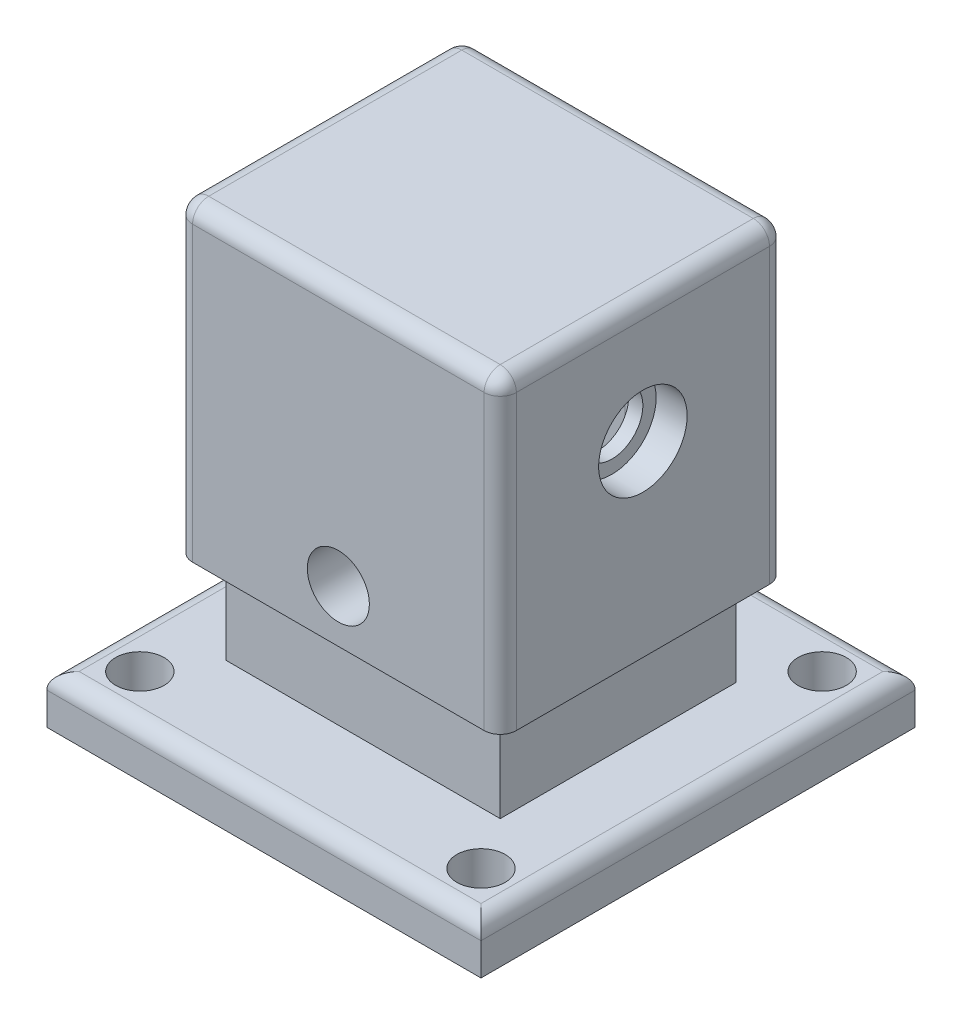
from build123d import *

# Parameters (mm, degrees)
SKETCH1_W                 = 88.9
SKETCH1_H                 = 88.9
SKETCH1_R                 = 4.953
BOSS_EXTRUDE2_DEPTH       = 9.906
SKETCH2_W                 = 56.134
SKETCH2_H                 = 48.26
BOSS_EXTRUDE3_DEPTH       = 19.05
SKETCH3_W                 = 66.294
SKETCH3_H                 = 58.42
BOSS_EXTRUDE4_DEPTH       = 63.246
SKETCH4_W                 = 47.752
SKETCH4_H                 = 25.4
CUT_EXTRUDE1_DEPTH        = 76.2
SKETCH5_W                 = 60.452
SKETCH5_H                 = 38.1
CUT_EXTRUDE4_DEPTH        = 3.302
SKETCH6_R                 = 6.35
CUT_EXTRUDE7_DEPTH        = 129.445730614
SKETCH7_R                 = 9.057721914
CUT_EXTRUDE8_DEPTH        = 6.35
SKETCH8_R                 = 6.35
CUT_EXTRUDE9_DEPTH        = 127.106331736
FILLET1_R                 = 3.302
FILLET2_R                 = 7.112
FILLET3_R                 = 3.302
F_4_40_TAPPED_HOLE3_D     = 2.2606
F_4_40_TAPPED_HOLE3_DEPTH = 8.89
F_4_40_TAPPED_HOLE3_TIP   = 0.679152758


with BuildPart() as part:
    # Sketch1 → Boss-Extrude2 (new body)
    with BuildSketch(Plane(origin=(0, 0, 0), x_dir=(1, 0, 0), z_dir=(0, 1, 0))):
        Rectangle(SKETCH1_W, SKETCH1_H)
        with Locations(Location((-34.925, 34.925, 0), (0, 0, 270))):
            Circle(SKETCH1_R, mode=Mode.SUBTRACT)
        with Locations(Location((34.925, 34.925, 0), (0, 0, 270))):
            Circle(SKETCH1_R, mode=Mode.SUBTRACT)
        with Locations(Location((34.925, -34.925, 0), (0, 0, 270))):
            Circle(SKETCH1_R, mode=Mode.SUBTRACT)
        with Locations(Location((-34.925, -34.925, 0), (0, 0, 270))):
            Circle(SKETCH1_R, mode=Mode.SUBTRACT)
    extrude(amount=BOSS_EXTRUDE2_DEPTH)

    # Sketch2 → Boss-Extrude3 (add)
    with BuildSketch(Plane(origin=(0, 9.906, 0), x_dir=(1, 0, 0), z_dir=(0, 1, 0))):
        Rectangle(SKETCH2_W, SKETCH2_H)
    extrude(amount=BOSS_EXTRUDE3_DEPTH)

    # Sketch3 → Boss-Extrude4 (add)
    with BuildSketch(Plane(origin=(0, 28.956, 0), x_dir=(1, 0, 0), z_dir=(0, 1, 0))):
        Rectangle(SKETCH3_W, SKETCH3_H)
    extrude(amount=BOSS_EXTRUDE4_DEPTH)

    # Sketch4 → Cut-Extrude1 (cut)
    with BuildSketch(Plane(origin=(0, 0, 0), x_dir=(-1, 0, 0), z_dir=(0, -1, 0))):
        Rectangle(SKETCH4_W, SKETCH4_H)
    extrude(amount=-CUT_EXTRUDE1_DEPTH, mode=Mode.SUBTRACT)

    # Sketch5 → Cut-Extrude4 (cut)
    with BuildSketch(Plane(origin=(0, 0, 0), x_dir=(-1, 0, 0), z_dir=(0, -1, 0))):
        Rectangle(SKETCH5_W, SKETCH5_H)
    extrude(amount=-CUT_EXTRUDE4_DEPTH, mode=Mode.SUBTRACT)

    # Sketch6 → Cut-Extrude7 (cut, through all)
    with BuildSketch(Plane(origin=(33.147, 0, 0), x_dir=(0, 0, -1), z_dir=(1, 0, 0))):
        with Locations((0, 67.31)):
            Circle(SKETCH6_R)
    extrude(amount=-CUT_EXTRUDE7_DEPTH, mode=Mode.SUBTRACT)

    # Sketch7 → Cut-Extrude8 (cut)
    with BuildSketch(Plane(origin=(33.147, 0, 0), x_dir=(0, 0, -1), z_dir=(1, 0, 0))):
        with Locations((0, 67.31)):
            Circle(SKETCH7_R)
    cut_extrude8 = extrude(amount=-CUT_EXTRUDE8_DEPTH, mode=Mode.SUBTRACT)

    # Mirror1: Cut-Extrude8 across plane
    add(cut_extrude8.mirror(Plane(origin=(0, 0, 0), x_dir=(0, 0, 1), z_dir=(1, 0, 0))), mode=Mode.SUBTRACT)

    # Sketch8 → Cut-Extrude9 (cut, through all)
    with BuildSketch(Plane.XY.offset(29.21)):
        with Locations((0, 39.624)):
            Circle(SKETCH8_R)
    extrude(amount=-CUT_EXTRUDE9_DEPTH, mode=Mode.SUBTRACT)

    # Fillet1
    fillet1_edges = [part.edges().sort_by_distance(p)[0] for p in [
        (-44.45, 9.906, 0),
        (0, 9.906, 44.45),
        (44.45, 9.906, 0),
        (33.147, 60.579, 29.21),
        (33.147, 60.579, -29.21),
        (-33.147, 60.579, -29.21),
        (-33.147, 60.579, 29.21),
        (33.147, 92.202, 0),
        (0, 92.202, -29.21),
        (-33.147, 92.202, 0),
        (0, 92.202, 29.21),
        (0, 9.906, -44.45),
    ]]
    fillet(fillet1_edges, radius=FILLET1_R)

    # Fillet2
    fillet2_edges = [part.edges().sort_by_distance(p)[0] for p in [
        (23.876, 39.751, 12.7),
        (23.876, 39.751, -12.7),
        (-23.876, 39.751, -12.7),
        (-23.876, 39.751, 12.7),
    ]]
    fillet(fillet2_edges, radius=FILLET2_R)

    # Fillet3
    fillet3_edges = [part.edges().sort_by_distance(p)[0] for p in [
        (30.226, 1.651, 19.05),
        (30.226, 1.651, -19.05),
        (-30.226, 1.651, -19.05),
        (-30.226, 1.651, 19.05),
    ]]
    fillet(fillet3_edges, radius=FILLET3_R)

    # 4-40 Tapped Hole3
    with Locations(Plane(origin=(0, 3.302, 0), x_dir=(-1, 0, 0), z_dir=(0, -1, 0))):
        with Locations((26.289, -15.113), (-26.289, -15.113), (-26.289, 15.113), (26.289, 15.113)):
            Hole(F_4_40_TAPPED_HOLE3_D / 2, depth=F_4_40_TAPPED_HOLE3_DEPTH)
            with Locations((0, 0, -(F_4_40_TAPPED_HOLE3_DEPTH + F_4_40_TAPPED_HOLE3_TIP / 2))):  # 118° drill point
                Cone(0, F_4_40_TAPPED_HOLE3_D / 2, F_4_40_TAPPED_HOLE3_TIP, mode=Mode.SUBTRACT)


solid = part.part
